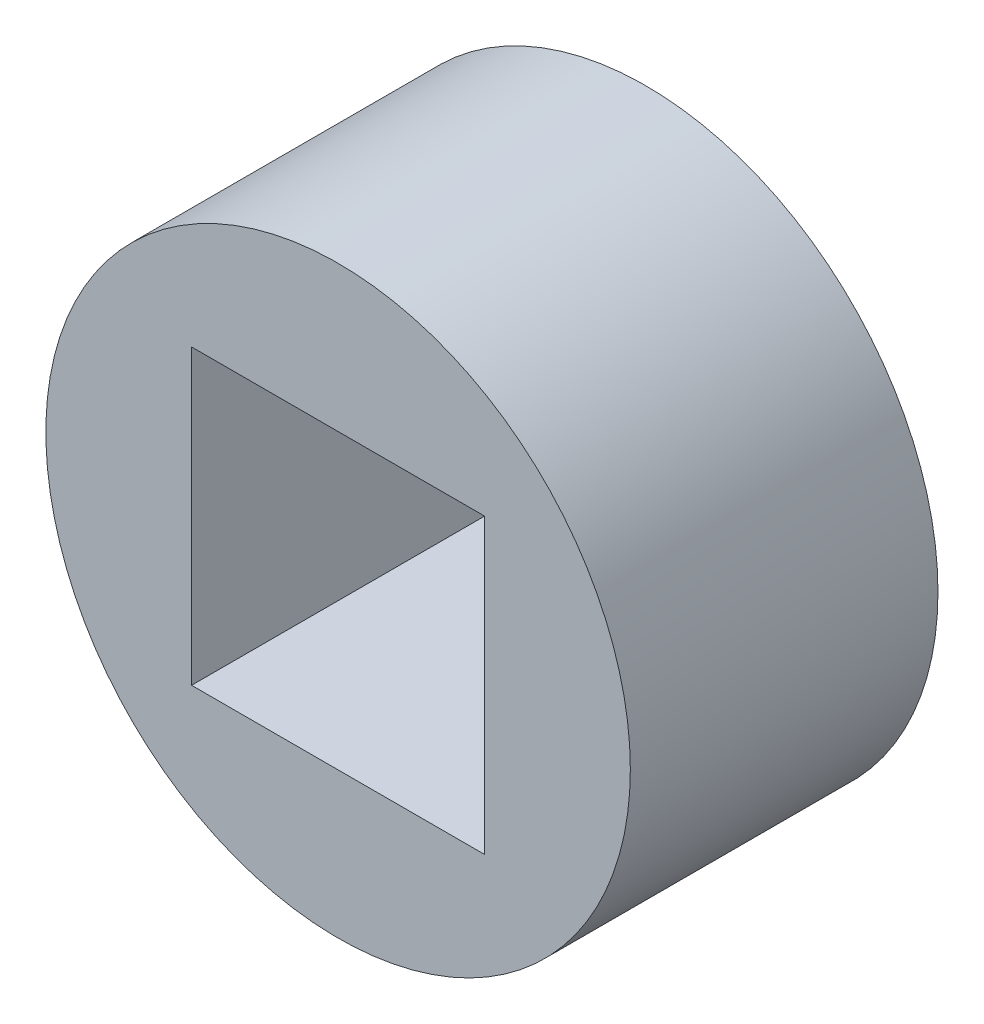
ISO-10303-21;
HEADER;
FILE_DESCRIPTION(('STEP AP214'),'2;1');
FILE_NAME('part.step','',(''),(''),'','','');
FILE_SCHEMA(('AUTOMOTIVE_DESIGN { 1 0 10303 214 1 1 1 1 }'));
ENDSEC;
DATA;
#1=APPLICATION_CONTEXT('core data for automotive mechanical design processes');
#2=APPLICATION_PROTOCOL_DEFINITION('international standard','automotive_design',2000,#1);
#3=PRODUCT_CONTEXT('',#1,'mechanical');
#4=PRODUCT('Part','Part','',(#3));
#5=PRODUCT_RELATED_PRODUCT_CATEGORY('part','',(#4));
#6=PRODUCT_DEFINITION_FORMATION('','',#4);
#7=PRODUCT_DEFINITION_CONTEXT('part definition',#1,'design');
#8=PRODUCT_DEFINITION('design','',#6,#7);
#9=PRODUCT_DEFINITION_SHAPE('','',#8);
#10=(LENGTH_UNIT() NAMED_UNIT(*) SI_UNIT(.MILLI.,.METRE.));
#11=(NAMED_UNIT(*) PLANE_ANGLE_UNIT() SI_UNIT($,.RADIAN.));
#12=(NAMED_UNIT(*) SI_UNIT($,.STERADIAN.) SOLID_ANGLE_UNIT());
#13=UNCERTAINTY_MEASURE_WITH_UNIT(LENGTH_MEASURE(1.E-05),#10,'distance_accuracy_value','');
#14=(GEOMETRIC_REPRESENTATION_CONTEXT(3) GLOBAL_UNCERTAINTY_ASSIGNED_CONTEXT((#13)) GLOBAL_UNIT_ASSIGNED_CONTEXT((#10,
#11,#12)) REPRESENTATION_CONTEXT('',''));
#15=CARTESIAN_POINT('',(0.,0.,0.));
#16=DIRECTION('',(0.,0.,1.));
#17=DIRECTION('',(1.,0.,0.));
#18=AXIS2_PLACEMENT_3D('',#15,#16,#17);
#19=CARTESIAN_POINT('',(0.,0.,10.));
#20=DIRECTION('',(0.,0.,1.));
#21=DIRECTION('',(1.,0.,0.));
#22=AXIS2_PLACEMENT_3D('',#19,#20,#21);
#23=PLANE('',#22);
#24=CARTESIAN_POINT('',(0.,0.,10.));
#25=DIRECTION('',(0.,0.,1.));
#26=DIRECTION('',(1.,0.,0.));
#27=AXIS2_PLACEMENT_3D('',#24,#25,#26);
#28=CIRCLE('',#27,9.5);
#29=CARTESIAN_POINT('',(9.5,0.,10.));
#30=VERTEX_POINT('',#29);
#31=EDGE_CURVE('E11',#30,#30,#28,.T.);
#32=ORIENTED_EDGE('',*,*,#31,.T.);
#33=EDGE_LOOP('',(#32));
#34=FACE_BOUND('',#33,.T.);
#35=DIRECTION('',(-1.,0.,0.));
#36=VECTOR('',#35,1.);
#37=CARTESIAN_POINT('',(-4.7625,4.7625,10.));
#38=LINE('',#37,#36);
#39=CARTESIAN_POINT('',(4.7625,4.7625,10.));
#40=VERTEX_POINT('',#39);
#41=CARTESIAN_POINT('',(-4.7625,4.7625,10.));
#42=VERTEX_POINT('',#41);
#43=EDGE_CURVE('E83',#40,#42,#38,.T.);
#44=ORIENTED_EDGE('',*,*,#43,.F.);
#45=DIRECTION('',(0.,1.,0.));
#46=VECTOR('',#45,1.);
#47=CARTESIAN_POINT('',(4.7625,4.7625,10.));
#48=LINE('',#47,#46);
#49=CARTESIAN_POINT('',(4.7625,-4.7625,10.));
#50=VERTEX_POINT('',#49);
#51=EDGE_CURVE('E75',#50,#40,#48,.T.);
#52=ORIENTED_EDGE('',*,*,#51,.F.);
#53=DIRECTION('',(1.,0.,0.));
#54=VECTOR('',#53,1.);
#55=CARTESIAN_POINT('',(-4.7625,-4.7625,10.));
#56=LINE('',#55,#54);
#57=CARTESIAN_POINT('',(-4.7625,-4.7625,10.));
#58=VERTEX_POINT('',#57);
#59=EDGE_CURVE('E96',#58,#50,#56,.T.);
#60=ORIENTED_EDGE('',*,*,#59,.F.);
#61=DIRECTION('',(0.,-1.,0.));
#62=VECTOR('',#61,1.);
#63=CARTESIAN_POINT('',(-4.7625,4.7625,10.));
#64=LINE('',#63,#62);
#65=EDGE_CURVE('E94',#42,#58,#64,.T.);
#66=ORIENTED_EDGE('',*,*,#65,.F.);
#67=EDGE_LOOP('',(#44,#52,#60,#66));
#68=FACE_BOUND('',#67,.T.);
#69=ADVANCED_FACE('F34',(#34,#68),#23,.T.);
#70=CARTESIAN_POINT('',(0.,0.,0.));
#71=DIRECTION('',(0.,0.,1.));
#72=DIRECTION('',(1.,0.,0.));
#73=AXIS2_PLACEMENT_3D('',#70,#71,#72);
#74=PLANE('',#73);
#75=CARTESIAN_POINT('',(0.,0.,0.));
#76=DIRECTION('',(0.,0.,1.));
#77=DIRECTION('',(1.,0.,0.));
#78=AXIS2_PLACEMENT_3D('',#75,#76,#77);
#79=CIRCLE('',#78,9.5);
#80=CARTESIAN_POINT('',(9.5,0.,0.));
#81=VERTEX_POINT('',#80);
#82=EDGE_CURVE('E38',#81,#81,#79,.T.);
#83=ORIENTED_EDGE('',*,*,#82,.F.);
#84=EDGE_LOOP('',(#83));
#85=FACE_BOUND('',#84,.T.);
#86=DIRECTION('',(0.,1.,0.));
#87=VECTOR('',#86,1.);
#88=CARTESIAN_POINT('',(4.7625,4.7625,0.));
#89=LINE('',#88,#87);
#90=CARTESIAN_POINT('',(4.7625,-4.7625,0.));
#91=VERTEX_POINT('',#90);
#92=CARTESIAN_POINT('',(4.7625,4.7625,0.));
#93=VERTEX_POINT('',#92);
#94=EDGE_CURVE('E57',#91,#93,#89,.T.);
#95=ORIENTED_EDGE('',*,*,#94,.T.);
#96=DIRECTION('',(-1.,0.,0.));
#97=VECTOR('',#96,1.);
#98=CARTESIAN_POINT('',(-4.7625,4.7625,0.));
#99=LINE('',#98,#97);
#100=CARTESIAN_POINT('',(-4.7625,4.7625,0.));
#101=VERTEX_POINT('',#100);
#102=EDGE_CURVE('E90',#93,#101,#99,.T.);
#103=ORIENTED_EDGE('',*,*,#102,.T.);
#104=DIRECTION('',(0.,-1.,0.));
#105=VECTOR('',#104,1.);
#106=CARTESIAN_POINT('',(-4.7625,4.7625,0.));
#107=LINE('',#106,#105);
#108=CARTESIAN_POINT('',(-4.7625,-4.7625,0.));
#109=VERTEX_POINT('',#108);
#110=EDGE_CURVE('E102',#101,#109,#107,.T.);
#111=ORIENTED_EDGE('',*,*,#110,.T.);
#112=DIRECTION('',(1.,0.,0.));
#113=VECTOR('',#112,1.);
#114=CARTESIAN_POINT('',(-4.7625,-4.7625,0.));
#115=LINE('',#114,#113);
#116=EDGE_CURVE('E84',#109,#91,#115,.T.);
#117=ORIENTED_EDGE('',*,*,#116,.T.);
#118=EDGE_LOOP('',(#95,#103,#111,#117));
#119=FACE_BOUND('',#118,.T.);
#120=ADVANCED_FACE('F113',(#85,#119),#74,.F.);
#121=CARTESIAN_POINT('',(0.,0.,10.));
#122=DIRECTION('',(0.,0.,-1.));
#123=DIRECTION('',(-1.,0.,0.));
#124=AXIS2_PLACEMENT_3D('',#121,#122,#123);
#125=CYLINDRICAL_SURFACE('',#124,9.5);
#126=ORIENTED_EDGE('',*,*,#31,.F.);
#127=EDGE_LOOP('',(#126));
#128=FACE_BOUND('',#127,.T.);
#129=ORIENTED_EDGE('',*,*,#82,.T.);
#130=EDGE_LOOP('',(#129));
#131=FACE_BOUND('',#130,.T.);
#132=ADVANCED_FACE('F36',(#128,#131),#125,.T.);
#133=CARTESIAN_POINT('',(4.7625,4.7625,10.));
#134=DIRECTION('',(-1.,0.,0.));
#135=DIRECTION('',(0.,-1.,0.));
#136=AXIS2_PLACEMENT_3D('',#133,#134,#135);
#137=PLANE('',#136);
#138=ORIENTED_EDGE('',*,*,#94,.F.);
#139=DIRECTION('',(0.,0.,-1.));
#140=VECTOR('',#139,1.);
#141=CARTESIAN_POINT('',(4.7625,-4.7625,10.));
#142=LINE('',#141,#140);
#143=EDGE_CURVE('E79',#50,#91,#142,.T.);
#144=ORIENTED_EDGE('',*,*,#143,.F.);
#145=ORIENTED_EDGE('',*,*,#51,.T.);
#146=DIRECTION('',(0.,0.,-1.));
#147=VECTOR('',#146,1.);
#148=CARTESIAN_POINT('',(4.7625,4.7625,10.));
#149=LINE('',#148,#147);
#150=EDGE_CURVE('E78',#40,#93,#149,.T.);
#151=ORIENTED_EDGE('',*,*,#150,.T.);
#152=EDGE_LOOP('',(#138,#144,#145,#151));
#153=FACE_BOUND('',#152,.T.);
#154=ADVANCED_FACE('F77',(#153),#137,.T.);
#155=CARTESIAN_POINT('',(-4.7625,4.7625,10.));
#156=DIRECTION('',(0.,-1.,0.));
#157=DIRECTION('',(0.,0.,-1.));
#158=AXIS2_PLACEMENT_3D('',#155,#156,#157);
#159=PLANE('',#158);
#160=ORIENTED_EDGE('',*,*,#102,.F.);
#161=ORIENTED_EDGE('',*,*,#150,.F.);
#162=ORIENTED_EDGE('',*,*,#43,.T.);
#163=DIRECTION('',(0.,0.,-1.));
#164=VECTOR('',#163,1.);
#165=CARTESIAN_POINT('',(-4.7625,4.7625,10.));
#166=LINE('',#165,#164);
#167=EDGE_CURVE('E91',#42,#101,#166,.T.);
#168=ORIENTED_EDGE('',*,*,#167,.T.);
#169=EDGE_LOOP('',(#160,#161,#162,#168));
#170=FACE_BOUND('',#169,.T.);
#171=ADVANCED_FACE('F87',(#170),#159,.T.);
#172=CARTESIAN_POINT('',(-4.7625,4.7625,10.));
#173=DIRECTION('',(1.,0.,0.));
#174=DIRECTION('',(0.,1.,0.));
#175=AXIS2_PLACEMENT_3D('',#172,#173,#174);
#176=PLANE('',#175);
#177=ORIENTED_EDGE('',*,*,#110,.F.);
#178=ORIENTED_EDGE('',*,*,#167,.F.);
#179=ORIENTED_EDGE('',*,*,#65,.T.);
#180=DIRECTION('',(0.,0.,-1.));
#181=VECTOR('',#180,1.);
#182=CARTESIAN_POINT('',(-4.7625,-4.7625,10.));
#183=LINE('',#182,#181);
#184=EDGE_CURVE('E49',#58,#109,#183,.T.);
#185=ORIENTED_EDGE('',*,*,#184,.T.);
#186=EDGE_LOOP('',(#177,#178,#179,#185));
#187=FACE_BOUND('',#186,.T.);
#188=ADVANCED_FACE('F111',(#187),#176,.T.);
#189=CARTESIAN_POINT('',(-4.7625,-4.7625,10.));
#190=DIRECTION('',(0.,1.,0.));
#191=DIRECTION('',(0.,0.,1.));
#192=AXIS2_PLACEMENT_3D('',#189,#190,#191);
#193=PLANE('',#192);
#194=ORIENTED_EDGE('',*,*,#116,.F.);
#195=ORIENTED_EDGE('',*,*,#184,.F.);
#196=ORIENTED_EDGE('',*,*,#59,.T.);
#197=ORIENTED_EDGE('',*,*,#143,.T.);
#198=EDGE_LOOP('',(#194,#195,#196,#197));
#199=FACE_BOUND('',#198,.T.);
#200=ADVANCED_FACE('F114',(#199),#193,.T.);
#201=CLOSED_SHELL('',(#69,#120,#132,#154,#171,#188,#200));
#202=MANIFOLD_SOLID_BREP('B2',#201);
#203=ADVANCED_BREP_SHAPE_REPRESENTATION('',(#18,#202),#14);
#204=SHAPE_DEFINITION_REPRESENTATION(#9,#203);
ENDSEC;
END-ISO-10303-21;
